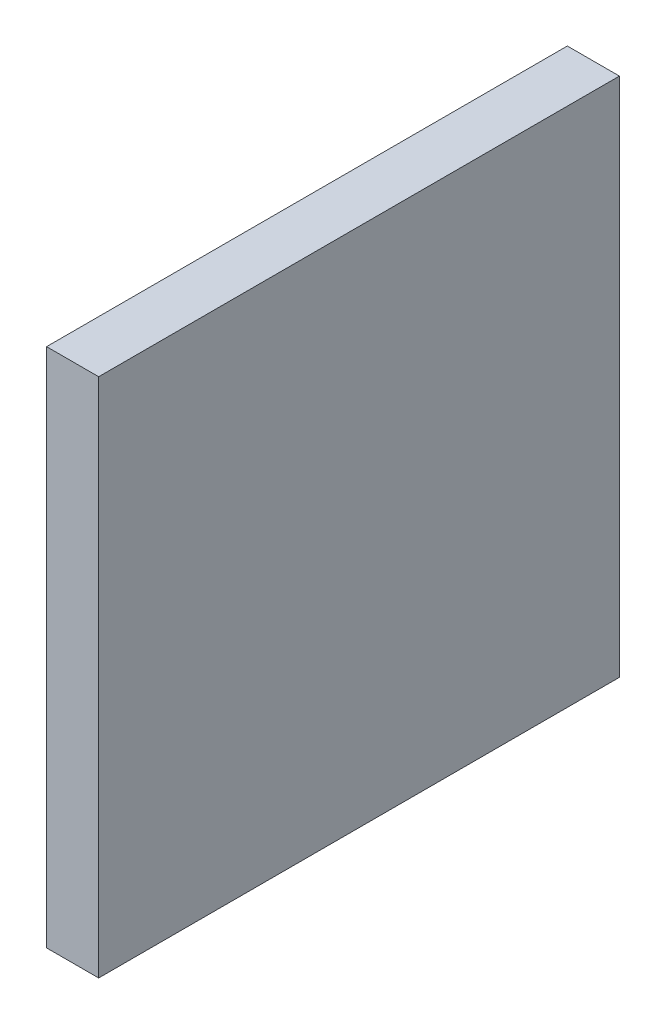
from build123d import *

# Parameters (mm, degrees)
SKETCH1_W           = 25.4
SKETCH1_H           = 25.4
BOSS_EXTRUDE1_DEPTH = 2.54


with BuildPart() as part:
    # Sketch1 → Boss-Extrude1 (new body)
    with BuildSketch(Plane(origin=(0, 0, 0), x_dir=(0, 0, -1), z_dir=(1, 0, 0))):
        with Locations((12.7, 12.7)):
            Rectangle(SKETCH1_W, SKETCH1_H)
    extrude(amount=BOSS_EXTRUDE1_DEPTH)


solid = part.part
